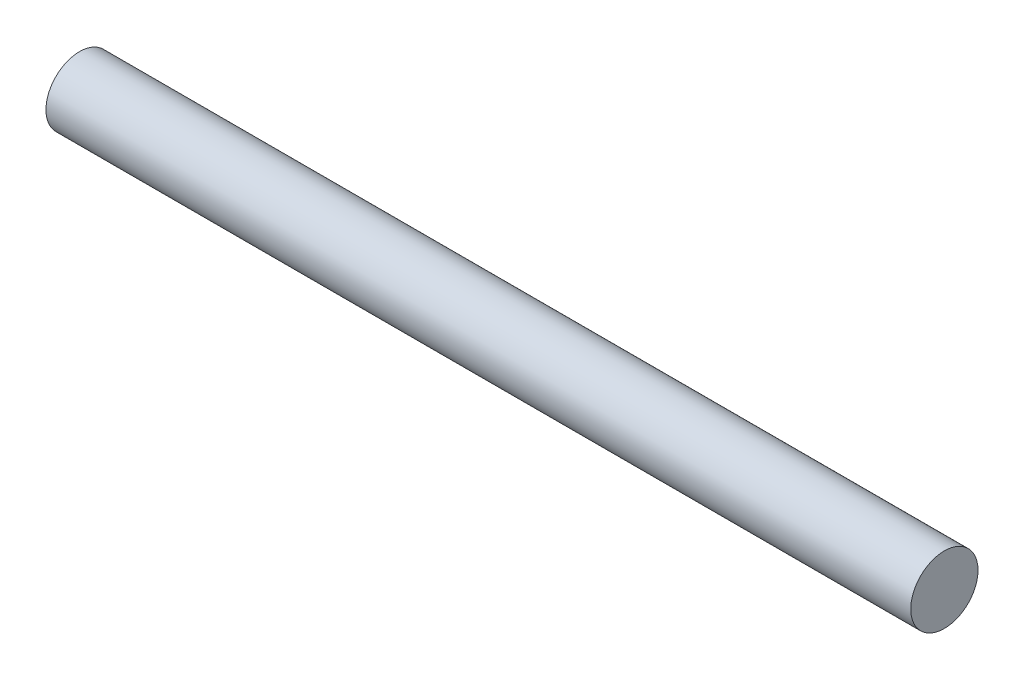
from build123d import *

# Parameters (mm, degrees)
SKETCH1_R           = 1.4
BOSS_EXTRUDE2_DEPTH = 36


with BuildPart() as part:
    # Sketch1 → Boss-Extrude2 (new body)
    with BuildSketch(Plane(origin=(0, 0, 0), x_dir=(0, 0, -1), z_dir=(1, 0, 0))):
        Circle(SKETCH1_R)
    extrude(amount=BOSS_EXTRUDE2_DEPTH)


solid = part.part
